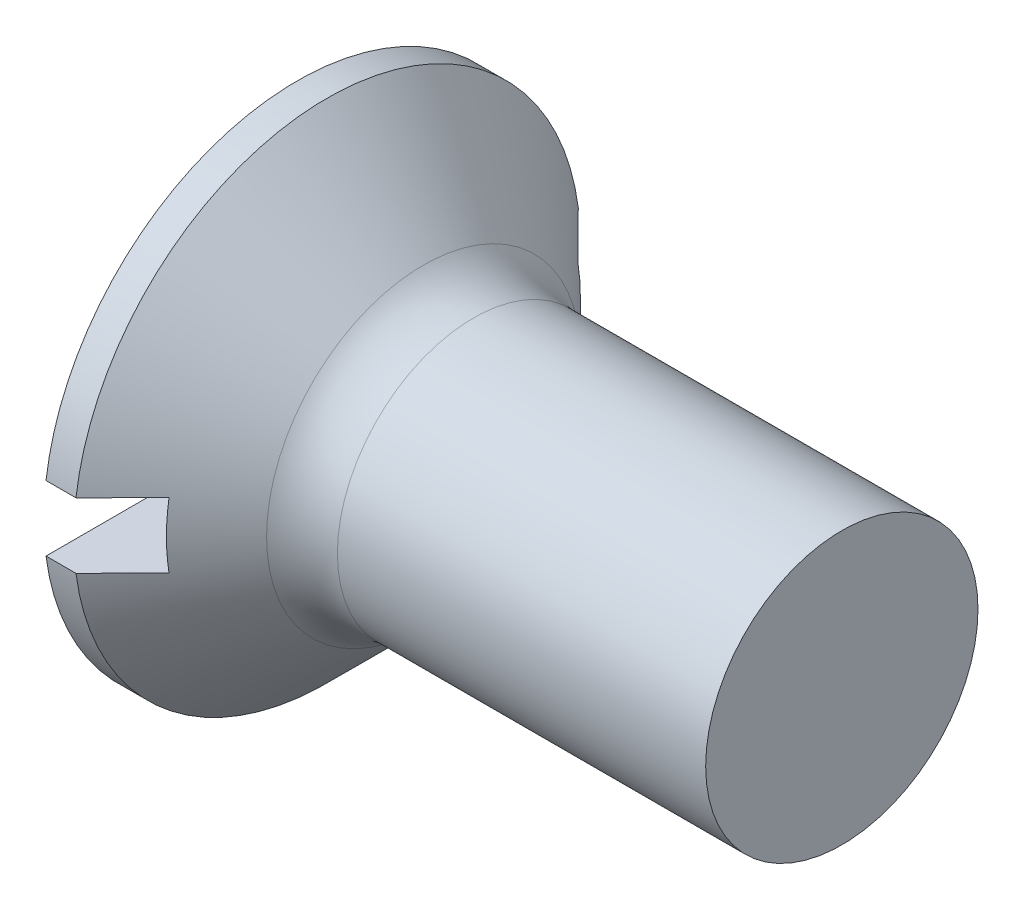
ISO-10303-21;
HEADER;
FILE_DESCRIPTION(('STEP AP214'),'2;1');
FILE_NAME('part.step','',(''),(''),'','','');
FILE_SCHEMA(('AUTOMOTIVE_DESIGN { 1 0 10303 214 1 1 1 1 }'));
ENDSEC;
DATA;
#1=APPLICATION_CONTEXT('core data for automotive mechanical design processes');
#2=APPLICATION_PROTOCOL_DEFINITION('international standard','automotive_design',2000,#1);
#3=PRODUCT_CONTEXT('',#1,'mechanical');
#4=PRODUCT('Part','Part','',(#3));
#5=PRODUCT_RELATED_PRODUCT_CATEGORY('part','',(#4));
#6=PRODUCT_DEFINITION_FORMATION('','',#4);
#7=PRODUCT_DEFINITION_CONTEXT('part definition',#1,'design');
#8=PRODUCT_DEFINITION('design','',#6,#7);
#9=PRODUCT_DEFINITION_SHAPE('','',#8);
#10=(LENGTH_UNIT() NAMED_UNIT(*) SI_UNIT(.MILLI.,.METRE.));
#11=(NAMED_UNIT(*) PLANE_ANGLE_UNIT() SI_UNIT($,.RADIAN.));
#12=(NAMED_UNIT(*) SI_UNIT($,.STERADIAN.) SOLID_ANGLE_UNIT());
#13=UNCERTAINTY_MEASURE_WITH_UNIT(LENGTH_MEASURE(1.E-05),#10,'distance_accuracy_value','');
#14=(GEOMETRIC_REPRESENTATION_CONTEXT(3) GLOBAL_UNCERTAINTY_ASSIGNED_CONTEXT((#13)) GLOBAL_UNIT_ASSIGNED_CONTEXT((#10,
#11,#12)) REPRESENTATION_CONTEXT('',''));
#15=CARTESIAN_POINT('',(0.,0.,0.));
#16=DIRECTION('',(0.,0.,1.));
#17=DIRECTION('',(1.,0.,0.));
#18=AXIS2_PLACEMENT_3D('',#15,#16,#17);
#19=CARTESIAN_POINT('',(0.,0.,0.));
#20=DIRECTION('',(-1.,0.,0.));
#21=DIRECTION('',(0.,0.,1.));
#22=AXIS2_PLACEMENT_3D('',#19,#20,#21);
#23=PLANE('',#22);
#24=DIRECTION('',(0.,0.,-1.));
#25=VECTOR('',#24,1.);
#26=CARTESIAN_POINT('',(0.,0.600000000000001,4.65));
#27=LINE('',#26,#25);
#28=CARTESIAN_POINT('',(0.,0.600000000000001,4.61112784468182));
#29=VERTEX_POINT('',#28);
#30=CARTESIAN_POINT('',(0.,0.599999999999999,-4.61112784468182));
#31=VERTEX_POINT('',#30);
#32=EDGE_CURVE('E169',#29,#31,#27,.T.);
#33=ORIENTED_EDGE('',*,*,#32,.F.);
#34=CARTESIAN_POINT('',(0.,0.,0.));
#35=DIRECTION('',(-1.,0.,0.));
#36=DIRECTION('',(0.,0.,1.));
#37=AXIS2_PLACEMENT_3D('',#34,#35,#36);
#38=CIRCLE('',#37,4.65);
#39=EDGE_CURVE('E113',#29,#31,#38,.T.);
#40=ORIENTED_EDGE('',*,*,#39,.T.);
#41=EDGE_LOOP('',(#33,#40));
#42=FACE_BOUND('',#41,.T.);
#43=ADVANCED_FACE('F32',(#42),#23,.T.);
#44=CARTESIAN_POINT('',(-6.34999999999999,0.,0.));
#45=DIRECTION('',(-1.,0.,0.));
#46=DIRECTION('',(0.,0.,1.));
#47=AXIS2_PLACEMENT_3D('',#44,#45,#46);
#48=CYLINDRICAL_SURFACE('',#47,4.65);
#49=DIRECTION('',(-1.,0.,0.));
#50=VECTOR('',#49,1.);
#51=CARTESIAN_POINT('',(-6.34999999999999,0.599999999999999,-4.61112784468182));
#52=LINE('',#51,#50);
#53=CARTESIAN_POINT('',(0.550000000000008,0.599999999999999,-4.61112784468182));
#54=VERTEX_POINT('',#53);
#55=EDGE_CURVE('E60',#31,#54,#52,.F.);
#56=ORIENTED_EDGE('',*,*,#55,.F.);
#57=ORIENTED_EDGE('',*,*,#39,.F.);
#58=DIRECTION('',(-1.,0.,0.));
#59=VECTOR('',#58,1.);
#60=CARTESIAN_POINT('',(-6.34999999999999,0.600000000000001,4.61112784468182));
#61=LINE('',#60,#59);
#62=CARTESIAN_POINT('',(0.550000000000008,0.600000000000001,4.61112784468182));
#63=VERTEX_POINT('',#62);
#64=EDGE_CURVE('E175',#63,#29,#61,.T.);
#65=ORIENTED_EDGE('',*,*,#64,.F.);
#66=CARTESIAN_POINT('',(0.550000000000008,0.,0.));
#67=DIRECTION('',(-1.,0.,0.));
#68=DIRECTION('',(0.,0.,1.));
#69=AXIS2_PLACEMENT_3D('',#66,#67,#68);
#70=CIRCLE('',#69,4.65);
#71=EDGE_CURVE('E107',#63,#54,#70,.T.);
#72=ORIENTED_EDGE('',*,*,#71,.T.);
#73=EDGE_LOOP('',(#56,#57,#65,#72));
#74=FACE_BOUND('',#73,.T.);
#75=ADVANCED_FACE('F153',(#74),#48,.T.);
#76=DIRECTION('',(0.,0.,1.));
#77=VECTOR('',#76,1.);
#78=CARTESIAN_POINT('',(0.,-0.600000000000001,-4.65));
#79=LINE('',#78,#77);
#80=CARTESIAN_POINT('',(0.,-0.600000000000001,-4.61112784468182));
#81=VERTEX_POINT('',#80);
#82=CARTESIAN_POINT('',(0.,-0.600000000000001,4.61112784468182));
#83=VERTEX_POINT('',#82);
#84=EDGE_CURVE('E101',#81,#83,#79,.T.);
#85=ORIENTED_EDGE('',*,*,#84,.F.);
#86=EDGE_CURVE('E109',#81,#83,#38,.T.);
#87=ORIENTED_EDGE('',*,*,#86,.T.);
#88=EDGE_LOOP('',(#85,#87));
#89=FACE_BOUND('',#88,.T.);
#90=ADVANCED_FACE('F155',(#89),#23,.T.);
#91=DIRECTION('',(-1.,0.,0.));
#92=VECTOR('',#91,1.);
#93=CARTESIAN_POINT('',(-6.34999999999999,-0.600000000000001,4.61112784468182));
#94=LINE('',#93,#92);
#95=CARTESIAN_POINT('',(0.550000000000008,-0.600000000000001,4.61112784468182));
#96=VERTEX_POINT('',#95);
#97=EDGE_CURVE('E174',#83,#96,#94,.F.);
#98=ORIENTED_EDGE('',*,*,#97,.F.);
#99=ORIENTED_EDGE('',*,*,#86,.F.);
#100=DIRECTION('',(-1.,0.,0.));
#101=VECTOR('',#100,1.);
#102=CARTESIAN_POINT('',(-6.34999999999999,-0.600000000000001,-4.61112784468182));
#103=LINE('',#102,#101);
#104=CARTESIAN_POINT('',(0.550000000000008,-0.600000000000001,-4.61112784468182));
#105=VERTEX_POINT('',#104);
#106=EDGE_CURVE('E172',#105,#81,#103,.T.);
#107=ORIENTED_EDGE('',*,*,#106,.F.);
#108=EDGE_CURVE('E110',#105,#96,#70,.T.);
#109=ORIENTED_EDGE('',*,*,#108,.T.);
#110=EDGE_LOOP('',(#98,#99,#107,#109));
#111=FACE_BOUND('',#110,.T.);
#112=ADVANCED_FACE('F150',(#111),#48,.T.);
#113=CARTESIAN_POINT('',(0.550000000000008,0.,0.));
#114=DIRECTION('',(-1.,0.,0.));
#115=DIRECTION('',(0.,0.,1.));
#116=AXIS2_PLACEMENT_3D('',#113,#114,#115);
#117=CONICAL_SURFACE('',#116,4.65,0.78539816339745);
#118=CARTESIAN_POINT('',(-5.05345798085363,0.599999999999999,-10.2358878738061));
#119=CARTESIAN_POINT('',(-4.7063338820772,0.599999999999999,-9.88816346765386));
#120=CARTESIAN_POINT('',(-4.35923588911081,0.599999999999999,-9.54041298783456));
#121=CARTESIAN_POINT('',(-3.66512028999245,0.599999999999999,-8.84482295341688));
#122=CARTESIAN_POINT('',(-3.31810268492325,0.599999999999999,-8.49698339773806));
#123=CARTESIAN_POINT('',(-2.6240861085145,0.599999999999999,-7.80108810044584));
#124=CARTESIAN_POINT('',(-2.27708717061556,0.599999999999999,-7.45303232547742));
#125=CARTESIAN_POINT('',(-1.58327190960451,0.599999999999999,-6.75674744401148));
#126=CARTESIAN_POINT('',(-1.23645558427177,0.599999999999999,-6.40851833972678));
#127=CARTESIAN_POINT('',(-0.530234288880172,0.599999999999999,-5.69884909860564));
#128=CARTESIAN_POINT('',(-0.170839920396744,0.599999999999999,-5.3373984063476));
#129=CARTESIAN_POINT('',(0.367846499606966,0.599999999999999,-4.79480605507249));
#130=CARTESIAN_POINT('',(0.547344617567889,0.599999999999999,-4.61386901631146));
#131=CARTESIAN_POINT('',(0.906142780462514,0.599999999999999,-4.251800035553));
#132=CARTESIAN_POINT('',(1.08544282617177,0.6,-4.07066809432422));
#133=CARTESIAN_POINT('',(1.44372217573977,0.6,-3.70815209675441));
#134=CARTESIAN_POINT('',(1.62270153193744,0.6,-3.52676809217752));
#135=CARTESIAN_POINT('',(1.98021132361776,0.6,-3.16355280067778));
#136=CARTESIAN_POINT('',(2.1587417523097,0.6,-2.98172150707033));
#137=CARTESIAN_POINT('',(2.51504600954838,0.6,-2.61734150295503));
#138=CARTESIAN_POINT('',(2.69281988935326,0.6,-2.43479284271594));
#139=CARTESIAN_POINT('',(2.95840184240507,0.6,-2.15993102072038));
#140=CARTESIAN_POINT('',(3.0467482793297,0.6,-2.06813839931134));
#141=CARTESIAN_POINT('',(3.22290791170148,0.6,-1.8840432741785));
#142=CARTESIAN_POINT('',(3.31072111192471,0.6,-1.79174077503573));
#143=CARTESIAN_POINT('',(3.44507973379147,0.6,-1.64924720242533));
#144=CARTESIAN_POINT('',(3.49191887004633,0.6,-1.59933324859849));
#145=CARTESIAN_POINT('',(3.58528403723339,0.6,-1.49921165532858));
#146=CARTESIAN_POINT('',(3.63181006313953,0.6,-1.44900401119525));
#147=CARTESIAN_POINT('',(3.72427703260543,0.6,-1.348388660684));
#148=CARTESIAN_POINT('',(3.77021949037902,0.6,-1.29798234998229));
#149=CARTESIAN_POINT('',(3.86152904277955,0.6,-1.19665513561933));
#150=CARTESIAN_POINT('',(3.90689615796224,0.6,-1.1457342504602));
#151=CARTESIAN_POINT('',(4.01209252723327,0.6,-1.02578570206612));
#152=CARTESIAN_POINT('',(4.07160553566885,0.6,-0.956477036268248));
#153=CARTESIAN_POINT('',(4.15917887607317,0.6,-0.850702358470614));
#154=CARTESIAN_POINT('',(4.18818199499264,0.6,-0.815019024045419));
#155=CARTESIAN_POINT('',(4.24528795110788,0.6,-0.742941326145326));
#156=CARTESIAN_POINT('',(4.27339088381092,0.6,-0.706547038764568));
#157=CARTESIAN_POINT('',(4.32869682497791,0.6,-0.632291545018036));
#158=CARTESIAN_POINT('',(4.35588213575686,0.6,-0.594417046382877));
#159=CARTESIAN_POINT('',(4.40832254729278,0.6,-0.517260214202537));
#160=CARTESIAN_POINT('',(4.43357498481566,0.6,-0.477976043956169));
#161=CARTESIAN_POINT('',(4.48075024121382,0.6,-0.397940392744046));
#162=CARTESIAN_POINT('',(4.50270366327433,0.6,-0.357207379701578));
#163=CARTESIAN_POINT('',(4.54164745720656,0.6,-0.273493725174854));
#164=CARTESIAN_POINT('',(4.55865364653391,0.6,-0.230520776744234));
#165=CARTESIAN_POINT('',(4.58372379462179,0.6,-0.145820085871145));
#166=CARTESIAN_POINT('',(4.59242377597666,0.6,-0.104295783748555));
#167=CARTESIAN_POINT('',(4.59893532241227,0.6,-0.0414391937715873));
#168=CARTESIAN_POINT('',(4.60002000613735,0.6,-0.0204304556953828));
#169=CARTESIAN_POINT('',(4.59997943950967,0.6,0.0215839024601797));
#170=CARTESIAN_POINT('',(4.59885411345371,0.6,0.0425895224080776));
#171=CARTESIAN_POINT('',(4.59227145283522,0.6,0.10501520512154));
#172=CARTESIAN_POINT('',(4.58363501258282,0.6,0.1461245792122));
#173=CARTESIAN_POINT('',(4.565808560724,0.6,0.206345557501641));
#174=CARTESIAN_POINT('',(4.55901965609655,0.6,0.226250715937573));
#175=CARTESIAN_POINT('',(4.54410905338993,0.6,0.265557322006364));
#176=CARTESIAN_POINT('',(4.53598757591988,0.6,0.284958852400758));
#177=CARTESIAN_POINT('',(4.51162458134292,0.6,0.33886087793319));
#178=CARTESIAN_POINT('',(4.49415337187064,0.6,0.372800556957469));
#179=CARTESIAN_POINT('',(4.45684225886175,0.6,0.439365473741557));
#180=CARTESIAN_POINT('',(4.436999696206,0.6,0.471989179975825));
#181=CARTESIAN_POINT('',(4.39563171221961,0.6,0.53629862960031));
#182=CARTESIAN_POINT('',(4.37410080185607,0.6,0.567980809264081));
#183=CARTESIAN_POINT('',(4.32989042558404,0.6,0.630537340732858));
#184=CARTESIAN_POINT('',(4.30721068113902,0.6,0.661411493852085));
#185=CARTESIAN_POINT('',(4.23751211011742,0.6,0.753681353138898));
#186=CARTESIAN_POINT('',(4.18923822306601,0.6,0.814124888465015));
#187=CARTESIAN_POINT('',(4.0909576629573,0.6,0.933321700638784));
#188=CARTESIAN_POINT('',(4.04095530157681,0.6,0.992078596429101));
#189=CARTESIAN_POINT('',(3.94086297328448,0.6,1.10735067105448));
#190=CARTESIAN_POINT('',(3.89079728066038,0.6,1.16388697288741));
#191=CARTESIAN_POINT('',(3.78992367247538,0.6,1.27629304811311));
#192=CARTESIAN_POINT('',(3.73911573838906,0.6,1.33216280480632));
#193=CARTESIAN_POINT('',(3.58591315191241,0.6,1.49908452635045));
#194=CARTESIAN_POINT('',(3.4827535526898,0.6,1.609433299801));
#195=CARTESIAN_POINT('',(3.27521830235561,0.6,1.82922471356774));
#196=CARTESIAN_POINT('',(3.17084134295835,0.6,1.93866611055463));
#197=CARTESIAN_POINT('',(2.96141984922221,0.6,2.15689179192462));
#198=CARTESIAN_POINT('',(2.85637536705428,0.6,2.26567612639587));
#199=CARTESIAN_POINT('',(2.64692360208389,0.6,2.481710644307));
#200=CARTESIAN_POINT('',(2.5425207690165,0.6,2.58896514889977));
#201=CARTESIAN_POINT('',(2.33341496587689,0.6,2.80318525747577));
#202=CARTESIAN_POINT('',(2.22871198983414,0.6,2.91015085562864));
#203=CARTESIAN_POINT('',(1.91438863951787,0.6,3.23063427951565));
#204=CARTESIAN_POINT('',(1.70445280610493,0.6,3.44384256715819));
#205=CARTESIAN_POINT('',(1.22510768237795,0.6,3.9295930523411));
#206=CARTESIAN_POINT('',(0.955548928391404,0.600000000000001,4.20198758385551));
#207=CARTESIAN_POINT('',(0.416004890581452,0.600000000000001,4.74635530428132));
#208=CARTESIAN_POINT('',(0.146019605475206,0.600000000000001,5.01832849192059));
#209=CARTESIAN_POINT('',(-0.664426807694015,0.600000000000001,5.83398149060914));
#210=CARTESIAN_POINT('',(-1.2052682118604,0.600000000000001,6.37728333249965));
#211=CARTESIAN_POINT('',(-2.297244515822,0.600000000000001,7.47334328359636));
#212=CARTESIAN_POINT('',(-2.84838746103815,0.600000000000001,8.02609337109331));
#213=CARTESIAN_POINT('',(-3.95082527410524,0.600000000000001,9.1312059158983));
#214=CARTESIAN_POINT('',(-4.5021200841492,0.600000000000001,9.683568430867));
#215=CARTESIAN_POINT('',(-5.05345798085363,0.600000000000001,10.2358878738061));
#216=B_SPLINE_CURVE_WITH_KNOTS('',3,(#118,#119,#120,#121,#122,#123,#124,#125,#126,#127,#128,
#129,#130,#131,#132,#133,#134,#135,#136,#137,#138,#139,#140,#141,#142,#143,#144,#145,#146,#147,
#148,#149,#150,#151,#152,#153,#154,#155,#156,#157,#158,#159,#160,#161,#162,#163,#164,#165,#166,
#167,#168,#169,#170,#171,#172,#173,#174,#175,#176,#177,#178,#179,#180,#181,#182,#183,#184,#185,
#186,#187,#188,#189,#190,#191,#192,#193,#194,#195,#196,#197,#198,#199,#200,#201,#202,#203,#204,
#205,#206,#207,#208,#209,#210,#211,#212,#213,#214,#215),.UNSPECIFIED.,.F.,.F.,(4,2,2,2,2,2,2,2,
2,2,2,2,2,2,2,2,2,2,2,2,2,2,2,2,2,2,2,2,2,2,2,2,2,2,2,2,2,2,2,2,2,2,2,2,2,2,2,2,4),(0.,
1.47399683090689,2.94801247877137,4.4224478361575,5.89686482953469,7.42601395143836,
8.19061836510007,8.95521977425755,9.71968231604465,10.4841563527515,11.2485777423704,
11.630779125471,12.0129770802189,12.2183239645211,12.4236741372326,12.6282760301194,
12.8328705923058,13.1068888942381,13.2448295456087,13.3827555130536,13.522578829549,
13.6625914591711,13.8012122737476,13.9393848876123,14.0658401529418,14.1288404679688,
14.1918429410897,14.3170190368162,14.3800826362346,14.4431358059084,14.557498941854,
14.6719915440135,14.7868731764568,14.9017827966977,15.1337679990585,15.365211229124,
15.5917537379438,15.8183019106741,16.2714608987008,16.7251625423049,17.1788291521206,
17.6278622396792,18.076904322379,18.9745538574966,20.1242253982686,21.2739004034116,
23.5737206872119,25.9154338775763,28.2566456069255),.UNSPECIFIED.);
#217=CARTESIAN_POINT('',(1.4,0.6,3.75233260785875));
#218=VERTEX_POINT('',#217);
#219=EDGE_CURVE('E11',#218,#63,#216,.T.);
#220=ORIENTED_EDGE('',*,*,#219,.F.);
#221=CARTESIAN_POINT('',(1.4,0.,0.));
#222=DIRECTION('',(1.,0.,0.));
#223=DIRECTION('',(0.,0.,-1.));
#224=AXIS2_PLACEMENT_3D('',#221,#222,#223);
#225=CIRCLE('',#224,3.80000000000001);
#226=CARTESIAN_POINT('',(1.4,-0.600000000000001,3.75233260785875));
#227=VERTEX_POINT('',#226);
#228=EDGE_CURVE('E89',#227,#218,#225,.F.);
#229=ORIENTED_EDGE('',*,*,#228,.F.);
#230=CARTESIAN_POINT('',(-5.05345798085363,-0.600000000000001,10.2358878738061));
#231=CARTESIAN_POINT('',(-4.7063338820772,-0.600000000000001,9.88816346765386));
#232=CARTESIAN_POINT('',(-4.35923588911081,-0.600000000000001,9.54041298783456));
#233=CARTESIAN_POINT('',(-3.66512028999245,-0.600000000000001,8.84482295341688));
#234=CARTESIAN_POINT('',(-3.31810268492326,-0.600000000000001,8.49698339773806));
#235=CARTESIAN_POINT('',(-2.6240861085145,-0.600000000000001,7.80108810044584));
#236=CARTESIAN_POINT('',(-2.27708717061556,-0.600000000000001,7.45303232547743));
#237=CARTESIAN_POINT('',(-1.58327190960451,-0.600000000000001,6.75674744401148));
#238=CARTESIAN_POINT('',(-1.23645558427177,-0.600000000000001,6.40851833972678));
#239=CARTESIAN_POINT('',(-0.530234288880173,-0.600000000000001,5.69884909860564));
#240=CARTESIAN_POINT('',(-0.170839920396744,-0.600000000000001,5.3373984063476));
#241=CARTESIAN_POINT('',(0.367846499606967,-0.600000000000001,4.79480605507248));
#242=CARTESIAN_POINT('',(0.547344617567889,-0.600000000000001,4.61386901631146));
#243=CARTESIAN_POINT('',(0.906142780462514,-0.600000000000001,4.251800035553));
#244=CARTESIAN_POINT('',(1.08544282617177,-0.600000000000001,4.07066809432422));
#245=CARTESIAN_POINT('',(1.44372217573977,-0.600000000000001,3.70815209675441));
#246=CARTESIAN_POINT('',(1.62270153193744,-0.600000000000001,3.52676809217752));
#247=CARTESIAN_POINT('',(1.98021132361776,-0.600000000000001,3.16355280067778));
#248=CARTESIAN_POINT('',(2.1587417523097,-0.600000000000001,2.98172150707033));
#249=CARTESIAN_POINT('',(2.51504600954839,-0.600000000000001,2.61734150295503));
#250=CARTESIAN_POINT('',(2.69281988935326,-0.600000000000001,2.43479284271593));
#251=CARTESIAN_POINT('',(2.95840184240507,-0.600000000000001,2.15993102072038));
#252=CARTESIAN_POINT('',(3.0467482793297,-0.600000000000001,2.06813839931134));
#253=CARTESIAN_POINT('',(3.22290791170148,-0.600000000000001,1.8840432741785));
#254=CARTESIAN_POINT('',(3.31072111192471,-0.600000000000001,1.79174077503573));
#255=CARTESIAN_POINT('',(3.44507973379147,-0.600000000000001,1.64924720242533));
#256=CARTESIAN_POINT('',(3.49191887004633,-0.600000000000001,1.59933324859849));
#257=CARTESIAN_POINT('',(3.58528403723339,-0.600000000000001,1.49921165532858));
#258=CARTESIAN_POINT('',(3.63181006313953,-0.600000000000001,1.44900401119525));
#259=CARTESIAN_POINT('',(3.72427703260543,-0.600000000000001,1.348388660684));
#260=CARTESIAN_POINT('',(3.77021949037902,-0.600000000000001,1.29798234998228));
#261=CARTESIAN_POINT('',(3.86152904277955,-0.600000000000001,1.19665513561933));
#262=CARTESIAN_POINT('',(3.90689615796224,-0.600000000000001,1.1457342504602));
#263=CARTESIAN_POINT('',(4.01209252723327,-0.600000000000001,1.02578570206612));
#264=CARTESIAN_POINT('',(4.07160553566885,-0.600000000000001,0.956477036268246));
#265=CARTESIAN_POINT('',(4.15917887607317,-0.600000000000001,0.850702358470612));
#266=CARTESIAN_POINT('',(4.18818199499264,-0.600000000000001,0.815019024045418));
#267=CARTESIAN_POINT('',(4.24528795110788,-0.600000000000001,0.742941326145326));
#268=CARTESIAN_POINT('',(4.27339088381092,-0.600000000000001,0.706547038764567));
#269=CARTESIAN_POINT('',(4.32869682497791,-0.600000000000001,0.632291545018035));
#270=CARTESIAN_POINT('',(4.35588213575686,-0.600000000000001,0.594417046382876));
#271=CARTESIAN_POINT('',(4.40832254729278,-0.600000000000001,0.517260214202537));
#272=CARTESIAN_POINT('',(4.43357498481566,-0.600000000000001,0.477976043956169));
#273=CARTESIAN_POINT('',(4.48075024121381,-0.600000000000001,0.397940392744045));
#274=CARTESIAN_POINT('',(4.50270366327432,-0.600000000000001,0.357207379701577));
#275=CARTESIAN_POINT('',(4.54164745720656,-0.600000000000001,0.273493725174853));
#276=CARTESIAN_POINT('',(4.55865364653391,-0.600000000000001,0.230520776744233));
#277=CARTESIAN_POINT('',(4.58372379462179,-0.600000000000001,0.145820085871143));
#278=CARTESIAN_POINT('',(4.59242377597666,-0.600000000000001,0.104295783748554));
#279=CARTESIAN_POINT('',(4.59893532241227,-0.600000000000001,0.0414391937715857));
#280=CARTESIAN_POINT('',(4.60002000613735,-0.600000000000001,0.0204304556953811));
#281=CARTESIAN_POINT('',(4.59997943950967,-0.600000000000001,-0.0215839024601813));
#282=CARTESIAN_POINT('',(4.59885411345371,-0.600000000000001,-0.0425895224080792));
#283=CARTESIAN_POINT('',(4.59227145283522,-0.600000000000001,-0.105015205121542));
#284=CARTESIAN_POINT('',(4.58363501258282,-0.600000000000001,-0.146124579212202));
#285=CARTESIAN_POINT('',(4.565808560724,-0.600000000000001,-0.206345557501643));
#286=CARTESIAN_POINT('',(4.55901965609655,-0.600000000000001,-0.226250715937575));
#287=CARTESIAN_POINT('',(4.54410905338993,-0.600000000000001,-0.265557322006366));
#288=CARTESIAN_POINT('',(4.53598757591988,-0.600000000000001,-0.284958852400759));
#289=CARTESIAN_POINT('',(4.51162458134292,-0.600000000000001,-0.338860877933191));
#290=CARTESIAN_POINT('',(4.49415337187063,-0.600000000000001,-0.37280055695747));
#291=CARTESIAN_POINT('',(4.45684225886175,-0.600000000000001,-0.439365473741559));
#292=CARTESIAN_POINT('',(4.43699969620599,-0.600000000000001,-0.471989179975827));
#293=CARTESIAN_POINT('',(4.3956317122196,-0.600000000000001,-0.536298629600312));
#294=CARTESIAN_POINT('',(4.37410080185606,-0.600000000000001,-0.567980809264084));
#295=CARTESIAN_POINT('',(4.32989042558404,-0.600000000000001,-0.630537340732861));
#296=CARTESIAN_POINT('',(4.30721068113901,-0.600000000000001,-0.661411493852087));
#297=CARTESIAN_POINT('',(4.23751211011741,-0.600000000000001,-0.753681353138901));
#298=CARTESIAN_POINT('',(4.18923822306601,-0.600000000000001,-0.814124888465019));
#299=CARTESIAN_POINT('',(4.09095766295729,-0.600000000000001,-0.933321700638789));
#300=CARTESIAN_POINT('',(4.04095530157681,-0.600000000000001,-0.992078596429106));
#301=CARTESIAN_POINT('',(3.94086297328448,-0.600000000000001,-1.10735067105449));
#302=CARTESIAN_POINT('',(3.89079728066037,-0.600000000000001,-1.16388697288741));
#303=CARTESIAN_POINT('',(3.78992367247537,-0.600000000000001,-1.27629304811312));
#304=CARTESIAN_POINT('',(3.73911573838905,-0.600000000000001,-1.33216280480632));
#305=CARTESIAN_POINT('',(3.5859131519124,-0.600000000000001,-1.49908452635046));
#306=CARTESIAN_POINT('',(3.48275355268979,-0.600000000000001,-1.60943329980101));
#307=CARTESIAN_POINT('',(3.2752183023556,-0.600000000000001,-1.82922471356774));
#308=CARTESIAN_POINT('',(3.17084134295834,-0.600000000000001,-1.93866611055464));
#309=CARTESIAN_POINT('',(2.9614198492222,-0.600000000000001,-2.15689179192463));
#310=CARTESIAN_POINT('',(2.85637536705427,-0.600000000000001,-2.26567612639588));
#311=CARTESIAN_POINT('',(2.64692360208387,-0.600000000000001,-2.48171064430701));
#312=CARTESIAN_POINT('',(2.54252076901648,-0.600000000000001,-2.58896514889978));
#313=CARTESIAN_POINT('',(2.33341496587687,-0.600000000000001,-2.80318525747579));
#314=CARTESIAN_POINT('',(2.22871198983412,-0.600000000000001,-2.91015085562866));
#315=CARTESIAN_POINT('',(1.91438863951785,-0.600000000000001,-3.23063427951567));
#316=CARTESIAN_POINT('',(1.70445280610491,-0.600000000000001,-3.44384256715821));
#317=CARTESIAN_POINT('',(1.22510768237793,-0.600000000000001,-3.92959305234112));
#318=CARTESIAN_POINT('',(0.955548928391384,-0.600000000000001,-4.20198758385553));
#319=CARTESIAN_POINT('',(0.416004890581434,-0.600000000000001,-4.74635530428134));
#320=CARTESIAN_POINT('',(0.146019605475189,-0.600000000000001,-5.01832849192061));
#321=CARTESIAN_POINT('',(-0.66442680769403,-0.600000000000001,-5.83398149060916));
#322=CARTESIAN_POINT('',(-1.20526821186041,-0.600000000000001,-6.37728333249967));
#323=CARTESIAN_POINT('',(-2.29724451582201,-0.600000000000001,-7.47334328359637));
#324=CARTESIAN_POINT('',(-2.84838746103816,-0.600000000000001,-8.02609337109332));
#325=CARTESIAN_POINT('',(-3.95082527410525,-0.600000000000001,-9.13120591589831));
#326=CARTESIAN_POINT('',(-4.5021200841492,-0.600000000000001,-9.68356843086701));
#327=CARTESIAN_POINT('',(-5.05345798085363,-0.600000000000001,-10.2358878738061));
#328=B_SPLINE_CURVE_WITH_KNOTS('',3,(#230,#231,#232,#233,#234,#235,#236,#237,#238,#239,#240,
#241,#242,#243,#244,#245,#246,#247,#248,#249,#250,#251,#252,#253,#254,#255,#256,#257,#258,#259,
#260,#261,#262,#263,#264,#265,#266,#267,#268,#269,#270,#271,#272,#273,#274,#275,#276,#277,#278,
#279,#280,#281,#282,#283,#284,#285,#286,#287,#288,#289,#290,#291,#292,#293,#294,#295,#296,#297,
#298,#299,#300,#301,#302,#303,#304,#305,#306,#307,#308,#309,#310,#311,#312,#313,#314,#315,#316,
#317,#318,#319,#320,#321,#322,#323,#324,#325,#326,#327),.UNSPECIFIED.,.F.,.F.,(4,2,2,2,2,2,2,2,
2,2,2,2,2,2,2,2,2,2,2,2,2,2,2,2,2,2,2,2,2,2,2,2,2,2,2,2,2,2,2,2,2,2,2,2,2,2,2,2,4),(0.,
1.47399683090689,2.94801247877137,4.4224478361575,5.89686482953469,7.42601395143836,
8.19061836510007,8.95521977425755,9.71968231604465,10.4841563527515,11.2485777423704,
11.630779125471,12.0129770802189,12.2183239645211,12.4236741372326,12.6282760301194,
12.8328705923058,13.1068888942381,13.2448295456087,13.3827555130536,13.522578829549,
13.6625914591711,13.8012122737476,13.9393848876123,14.0658401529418,14.1288404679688,
14.1918429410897,14.3170190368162,14.3800826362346,14.4431358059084,14.557498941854,
14.6719915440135,14.7868731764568,14.9017827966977,15.1337679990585,15.365211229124,
15.5917537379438,15.8183019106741,16.2714608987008,16.7251625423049,17.1788291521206,
17.6278622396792,18.076904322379,18.9745538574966,20.1242253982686,21.2739004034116,
23.5737206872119,25.9154338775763,28.2566456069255),.UNSPECIFIED.);
#329=EDGE_CURVE('E46',#96,#227,#328,.T.);
#330=ORIENTED_EDGE('',*,*,#329,.F.);
#331=ORIENTED_EDGE('',*,*,#108,.F.);
#332=CARTESIAN_POINT('',(1.4,-0.600000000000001,-3.75233260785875));
#333=VERTEX_POINT('',#332);
#334=EDGE_CURVE('E125',#333,#105,#328,.T.);
#335=ORIENTED_EDGE('',*,*,#334,.F.);
#336=CARTESIAN_POINT('',(1.4,0.6,-3.75233260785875));
#337=VERTEX_POINT('',#336);
#338=EDGE_CURVE('E97',#337,#333,#225,.F.);
#339=ORIENTED_EDGE('',*,*,#338,.F.);
#340=EDGE_CURVE('E36',#54,#337,#216,.T.);
#341=ORIENTED_EDGE('',*,*,#340,.F.);
#342=ORIENTED_EDGE('',*,*,#71,.F.);
#343=EDGE_LOOP('',(#220,#229,#330,#331,#335,#339,#341,#342));
#344=FACE_BOUND('',#343,.T.);
#345=CARTESIAN_POINT('',(2.31923881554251,0.,0.));
#346=DIRECTION('',(-1.,0.,0.));
#347=DIRECTION('',(0.,0.,1.));
#348=AXIS2_PLACEMENT_3D('',#345,#346,#347);
#349=CIRCLE('',#348,2.88076118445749);
#350=CARTESIAN_POINT('',(2.31923881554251,0.,2.88076118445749));
#351=VERTEX_POINT('',#350);
#352=EDGE_CURVE('E120',#351,#351,#349,.T.);
#353=ORIENTED_EDGE('',*,*,#352,.T.);
#354=EDGE_LOOP('',(#353));
#355=FACE_BOUND('',#354,.T.);
#356=ADVANCED_FACE('F104',(#344,#355),#117,.T.);
#357=CARTESIAN_POINT('',(-6.34999999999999,0.,0.));
#358=DIRECTION('',(-1.,0.,0.));
#359=DIRECTION('',(0.,0.,1.));
#360=AXIS2_PLACEMENT_3D('',#357,#358,#359);
#361=CYLINDRICAL_SURFACE('',#360,2.5);
#362=CARTESIAN_POINT('',(3.23847763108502,0.,0.));
#363=DIRECTION('',(-1.,0.,0.));
#364=DIRECTION('',(0.,0.,1.));
#365=AXIS2_PLACEMENT_3D('',#362,#363,#364);
#366=CIRCLE('',#365,2.5);
#367=CARTESIAN_POINT('',(3.23847763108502,0.,2.5));
#368=VERTEX_POINT('',#367);
#369=EDGE_CURVE('E123',#368,#368,#366,.F.);
#370=ORIENTED_EDGE('',*,*,#369,.T.);
#371=EDGE_LOOP('',(#370));
#372=FACE_BOUND('',#371,.T.);
#373=CARTESIAN_POINT('',(10.,0.,0.));
#374=DIRECTION('',(-1.,0.,0.));
#375=DIRECTION('',(0.,0.,1.));
#376=AXIS2_PLACEMENT_3D('',#373,#374,#375);
#377=CIRCLE('',#376,2.5);
#378=CARTESIAN_POINT('',(10.,0.,2.5));
#379=VERTEX_POINT('',#378);
#380=EDGE_CURVE('E116',#379,#379,#377,.T.);
#381=ORIENTED_EDGE('',*,*,#380,.T.);
#382=EDGE_LOOP('',(#381));
#383=FACE_BOUND('',#382,.T.);
#384=ADVANCED_FACE('F143',(#372,#383),#361,.T.);
#385=CARTESIAN_POINT('',(10.,2.5,0.));
#386=DIRECTION('',(1.,0.,0.));
#387=DIRECTION('',(0.,0.,-1.));
#388=AXIS2_PLACEMENT_3D('',#385,#386,#387);
#389=PLANE('',#388);
#390=ORIENTED_EDGE('',*,*,#380,.F.);
#391=EDGE_LOOP('',(#390));
#392=FACE_BOUND('',#391,.T.);
#393=ADVANCED_FACE('F141',(#392),#389,.T.);
#394=CARTESIAN_POINT('',(3.23847763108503,0.,0.));
#395=DIRECTION('',(-1.,0.,0.));
#396=DIRECTION('',(0.,0.,1.));
#397=AXIS2_PLACEMENT_3D('',#394,#395,#396);
#398=TOROIDAL_SURFACE('',#397,3.8,1.3);
#399=ORIENTED_EDGE('',*,*,#369,.F.);
#400=EDGE_LOOP('',(#399));
#401=FACE_BOUND('',#400,.T.);
#402=ORIENTED_EDGE('',*,*,#352,.F.);
#403=EDGE_LOOP('',(#402));
#404=FACE_BOUND('',#403,.T.);
#405=ADVANCED_FACE('F34',(#401,#404),#398,.F.);
#406=CARTESIAN_POINT('',(1.4,0.600000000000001,4.65));
#407=DIRECTION('',(0.,1.,0.));
#408=DIRECTION('',(0.,0.,1.));
#409=AXIS2_PLACEMENT_3D('',#406,#407,#408);
#410=PLANE('',#409);
#411=ORIENTED_EDGE('',*,*,#55,.T.);
#412=ORIENTED_EDGE('',*,*,#340,.T.);
#413=DIRECTION('',(0.,0.,-1.));
#414=VECTOR('',#413,1.);
#415=CARTESIAN_POINT('',(1.4,0.600000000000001,4.65));
#416=LINE('',#415,#414);
#417=EDGE_CURVE('E53',#218,#337,#416,.T.);
#418=ORIENTED_EDGE('',*,*,#417,.F.);
#419=ORIENTED_EDGE('',*,*,#219,.T.);
#420=ORIENTED_EDGE('',*,*,#64,.T.);
#421=ORIENTED_EDGE('',*,*,#32,.T.);
#422=EDGE_LOOP('',(#411,#412,#418,#419,#420,#421));
#423=FACE_BOUND('',#422,.T.);
#424=ADVANCED_FACE('F98',(#423),#410,.F.);
#425=CARTESIAN_POINT('',(1.4,-0.600000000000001,-4.65));
#426=DIRECTION('',(0.,-1.,0.));
#427=DIRECTION('',(0.,0.,-1.));
#428=AXIS2_PLACEMENT_3D('',#425,#426,#427);
#429=PLANE('',#428);
#430=ORIENTED_EDGE('',*,*,#97,.T.);
#431=ORIENTED_EDGE('',*,*,#329,.T.);
#432=DIRECTION('',(0.,0.,1.));
#433=VECTOR('',#432,1.);
#434=CARTESIAN_POINT('',(1.4,-0.600000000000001,-4.65));
#435=LINE('',#434,#433);
#436=EDGE_CURVE('E92',#333,#227,#435,.T.);
#437=ORIENTED_EDGE('',*,*,#436,.F.);
#438=ORIENTED_EDGE('',*,*,#334,.T.);
#439=ORIENTED_EDGE('',*,*,#106,.T.);
#440=ORIENTED_EDGE('',*,*,#84,.T.);
#441=EDGE_LOOP('',(#430,#431,#437,#438,#439,#440));
#442=FACE_BOUND('',#441,.T.);
#443=ADVANCED_FACE('F133',(#442),#429,.F.);
#444=CARTESIAN_POINT('',(1.4,-0.600000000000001,-4.65));
#445=DIRECTION('',(1.,0.,0.));
#446=DIRECTION('',(0.,0.,-1.));
#447=AXIS2_PLACEMENT_3D('',#444,#445,#446);
#448=PLANE('',#447);
#449=ORIENTED_EDGE('',*,*,#228,.T.);
#450=ORIENTED_EDGE('',*,*,#417,.T.);
#451=ORIENTED_EDGE('',*,*,#338,.T.);
#452=ORIENTED_EDGE('',*,*,#436,.T.);
#453=EDGE_LOOP('',(#449,#450,#451,#452));
#454=FACE_BOUND('',#453,.T.);
#455=ADVANCED_FACE('F90',(#454),#448,.F.);
#456=CLOSED_SHELL('',(#43,#75,#90,#112,#356,#384,#393,#405,#424,#443,#455));
#457=MANIFOLD_SOLID_BREP('B2',#456);
#458=ADVANCED_BREP_SHAPE_REPRESENTATION('',(#18,#457),#14);
#459=SHAPE_DEFINITION_REPRESENTATION(#9,#458);
ENDSEC;
END-ISO-10303-21;
